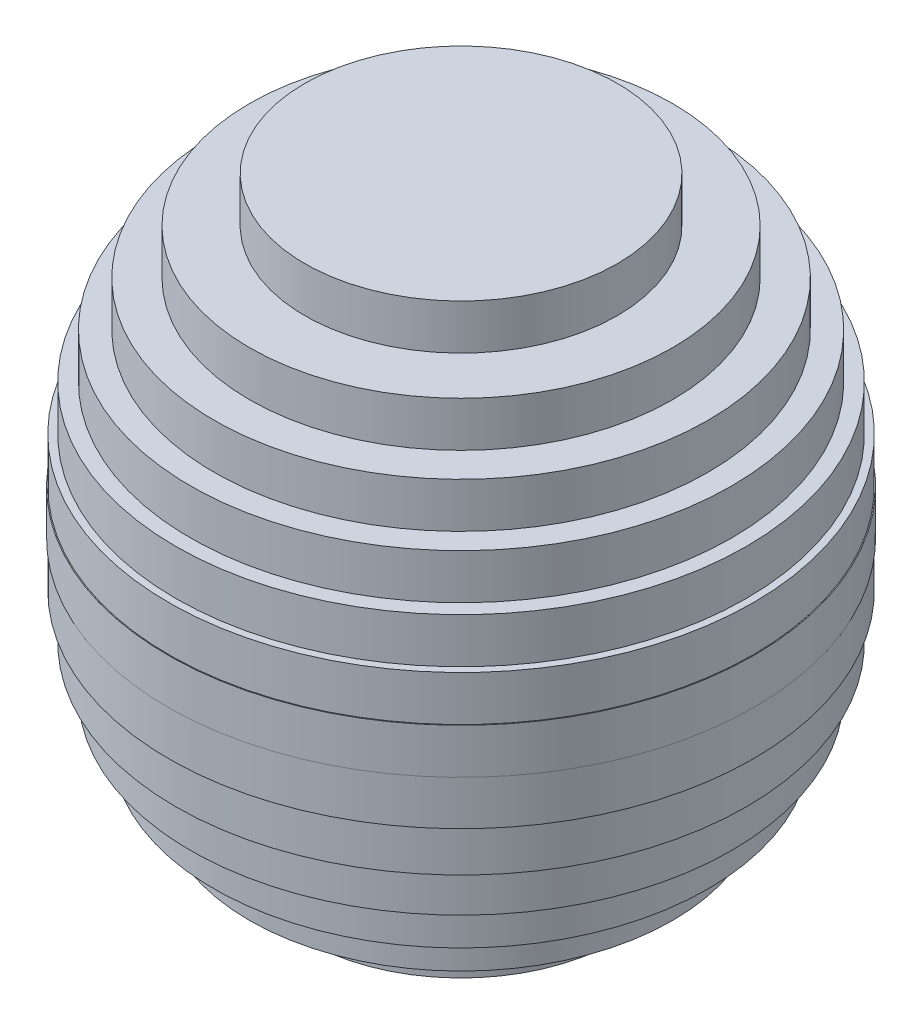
from build123d import *


with BuildPart() as part:
    # Sketch4 → Revolve1 (revolve)
    with BuildSketch(Plane.XY):
        Polygon((32.403703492, -2.5), (32.403703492, -7.5), (31.622776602, -7.5), (31.622776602, -12.5), (30, -12.5), (30, -17.5), (27.386127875, -17.5), (27.386127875, -22.5), (23.452078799, -22.5), (23.452078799, -27.5), (17.320508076, -27.5), (17.320508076, -32.5), (0, -32.5), (0, 32.5), (17.320508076, 32.5), (17.320508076, 27.5), (23.452078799, 27.5), (23.452078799, 22.5), (27.386127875, 22.5), (27.386127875, 17.5), (30, 17.5), (30, 12.5), (31.622776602, 12.5), (31.622776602, 7.5), (32.403703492, 7.5), (32.403703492, 2.5), (32.5, 2.5), (32.5, -2.5), align=None)
    revolve(axis=Axis((0, -32.5, 0), (0, 1, 0)))


solid = part.part
